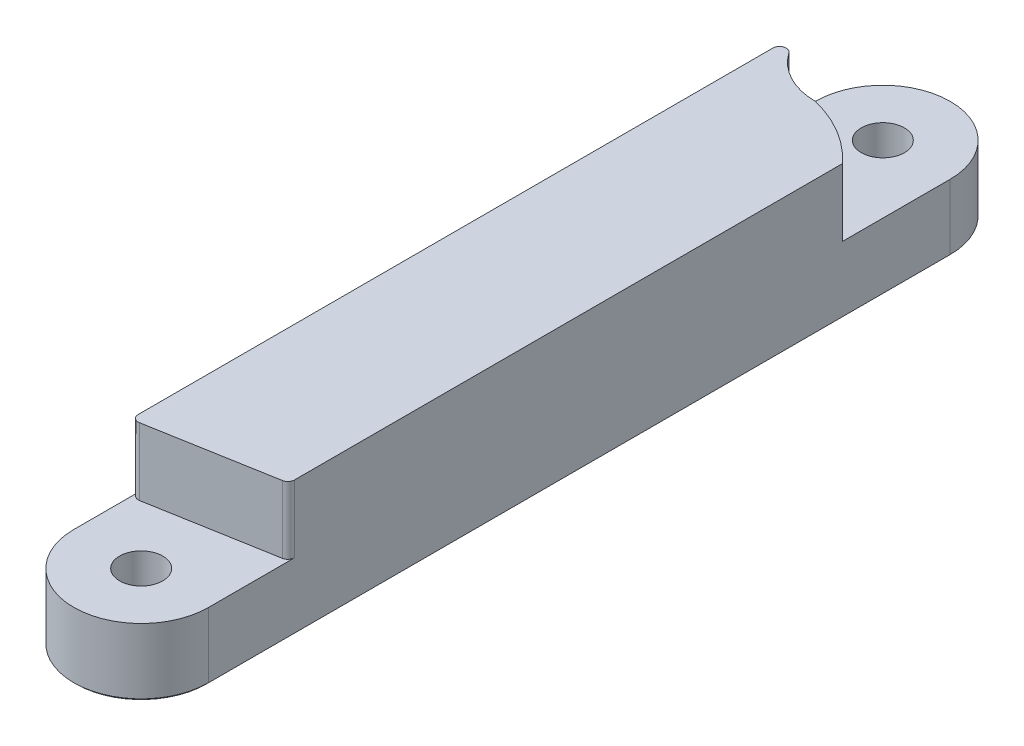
from build123d import *

# Parameters (mm, degrees)
CENTER_BODY_DEPTH               = 10
SKETCH1_3_R                     = 1.6
SKETCH1_3_R_2                   = 1.6000000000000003
CONNECTOR_BODY_DEPTH            = 5
MECH_LOCK_RIGHT_DEPTH           = 5
DULLING_FILLET_GENERAL_R        = 0.5
ELEPHANTSFOOT_COMPENSATION_SIZE = 0.16
DULLING_FILLET_RIGHT_R          = 0.5


with BuildPart() as part:
    # complete_sketch → center_body (new body)
    with BuildSketch(Plane(origin=(0, 0, 0), x_dir=(1, 0, 0), z_dir=(0, 1, 0))):
        Polygon((-5, 47), (-5, 4.195498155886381), (5, 5.958767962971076), (5, 47), align=None)
    extrude(amount=CENTER_BODY_DEPTH)

    # Sketch1_3 → connector_body (add)
    # profile 1 of 2: a face of its own
    with BuildSketch(Plane(origin=(0, 0, 0), x_dir=(1, 0, 0), z_dir=(0, 1, 0))):
        with BuildLine():
            Line((-5, 4.195498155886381), (-5, 0))
            ThreePointArc((-5, 0), (-3.1e-16, -5), (5, -6.1e-16))
            Line((5, 0), (5, 5.958767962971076))
            Line((5, 5.958767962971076), (-5, 4.195498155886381))
        make_face()
        with Locations(Location((0, 0, 0), (0, 0, 270))):
            Circle(SKETCH1_3_R, mode=Mode.SUBTRACT)
    # profile 2 of 2: a face of its own
    with BuildSketch(Plane(origin=(0, 0, 0), x_dir=(1, 0, 0), z_dir=(0, 1, 0))):
        with BuildLine():
            Line((-5, 52.70871215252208), (-5, 47))
            Line((-5, 47), (5, 47))
            Line((5, 47), (5, 52.70871215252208))
            Line((5, 52.70871215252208), (5, 55))
            ThreePointArc((5, 55), (-1.4e-16, 60), (-5, 55))
            Line((-5, 55), (-5, 52.70871215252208))
        make_face()
        with Locations(Location((0, 55, 0), (0, 0, 270))):
            Circle(SKETCH1_3_R_2, mode=Mode.SUBTRACT)
    extrude(amount=CONNECTOR_BODY_DEPTH)

    # Sketch2 → mech_lock_right (add)
    with BuildSketch(Plane(origin=(0, 5, 0), x_dir=(1, 0, 0), z_dir=(0, 1, 0))):
        with BuildLine():
            Line((5, 47), (-5, 47))
            Line((-5, 47), (-5, 55))
            ThreePointArc((-5, 55), (-3.5355339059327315, 51.46446609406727), (0, 50))
            ThreePointArc((0, 50), (2.7235158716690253, 48.87252645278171), (5, 47))
        make_face()
    extrude(amount=MECH_LOCK_RIGHT_DEPTH)

    # dulling_fillet_general
    dulling_fillet_general_edges = [part.edges().sort_by_distance(p)[0] for p in [
        (5, 7.5, -5.958767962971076),
        (-5, 7.5, -4.195498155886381),
    ]]
    fillet(dulling_fillet_general_edges, radius=DULLING_FILLET_GENERAL_R)

    # elephantsfoot_compensation
    elephantsfoot_compensation_edges = [part.edges().sort_by_distance(p)[0] for p in [
        (1.4e-16, 0, 5),
        (4.9e-16, 0, -1.6),
        (-1.4e-16, 0, -60),
        (4.9e-16, 0, -56.6),
        (5, 0, -27.5),
        (-5, 0, -27.5),
    ]]
    chamfer(elephantsfoot_compensation_edges, length=ELEPHANTSFOOT_COMPENSATION_SIZE)

    # dulling_fillet_right
    dulling_fillet_right_edges = [part.edges().sort_by_distance(p)[0] for p in [
        (-4.999999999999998, 7.5, -55),
    ]]
    fillet(dulling_fillet_right_edges, radius=DULLING_FILLET_RIGHT_R)


solid = part.part
